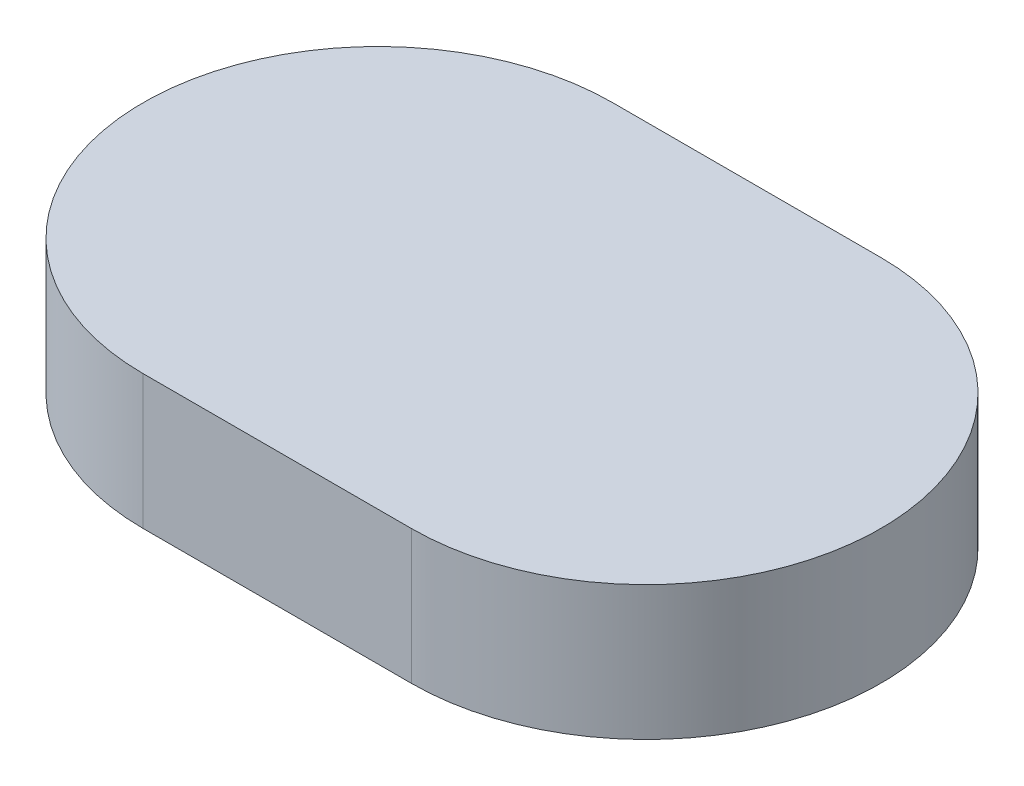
from build123d import *

# Parameters (mm, degrees)
BOSS_EXTRU_1_DEPTH = 2


with BuildPart() as part:
    # Esquisse1 → Boss.-Extru.1 (new body)
    with BuildSketch(Plane(origin=(0, 0, 0), x_dir=(1, 0, 0), z_dir=(0, 1, 0))):
        with BuildLine():
            Line((-2, 3.5), (2, 3.5))
            ThreePointArc((2, 3.5), (5.5, 0), (2, -3.5))
            Line((2, -3.5), (-2, -3.5))
            ThreePointArc((-2, -3.5), (-5.5, 0), (-2, 3.5))
        make_face()
    extrude(amount=BOSS_EXTRU_1_DEPTH)


solid = part.part
